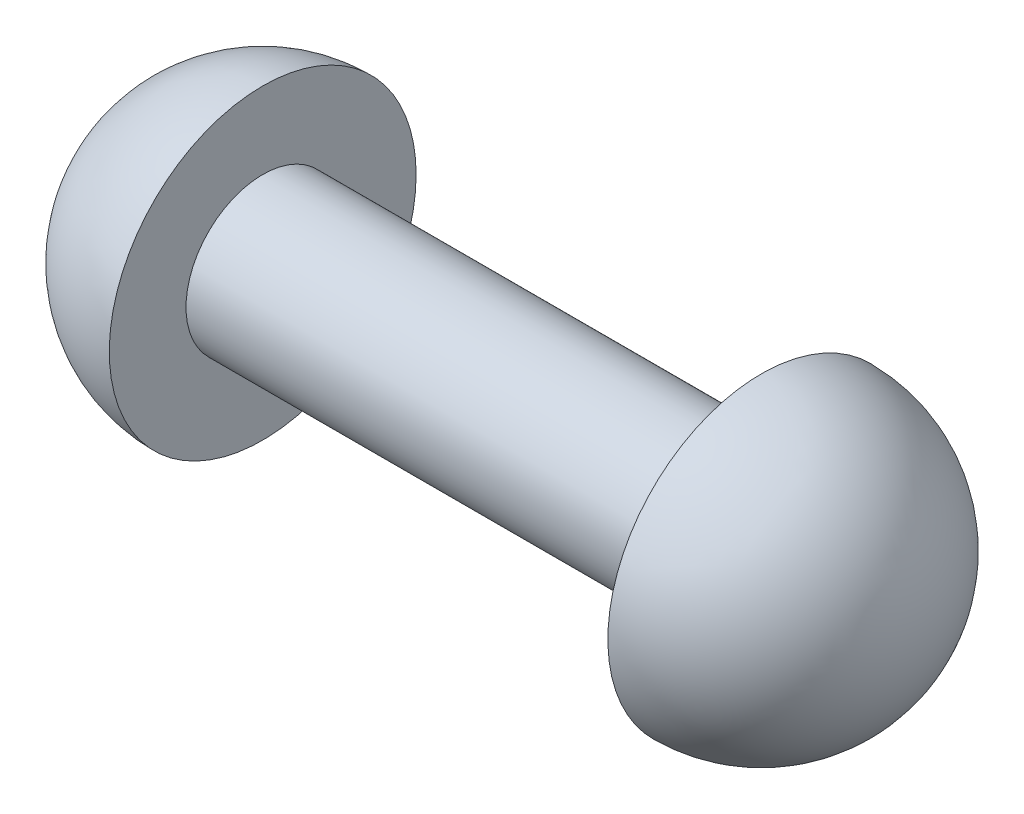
ISO-10303-21;
HEADER;
FILE_DESCRIPTION(('STEP AP214'),'2;1');
FILE_NAME('part.step','',(''),(''),'','','');
FILE_SCHEMA(('AUTOMOTIVE_DESIGN { 1 0 10303 214 1 1 1 1 }'));
ENDSEC;
DATA;
#1=APPLICATION_CONTEXT('core data for automotive mechanical design processes');
#2=APPLICATION_PROTOCOL_DEFINITION('international standard','automotive_design',2000,#1);
#3=PRODUCT_CONTEXT('',#1,'mechanical');
#4=PRODUCT('Part','Part','',(#3));
#5=PRODUCT_RELATED_PRODUCT_CATEGORY('part','',(#4));
#6=PRODUCT_DEFINITION_FORMATION('','',#4);
#7=PRODUCT_DEFINITION_CONTEXT('part definition',#1,'design');
#8=PRODUCT_DEFINITION('design','',#6,#7);
#9=PRODUCT_DEFINITION_SHAPE('','',#8);
#10=(LENGTH_UNIT() NAMED_UNIT(*) SI_UNIT(.MILLI.,.METRE.));
#11=(NAMED_UNIT(*) PLANE_ANGLE_UNIT() SI_UNIT($,.RADIAN.));
#12=(NAMED_UNIT(*) SI_UNIT($,.STERADIAN.) SOLID_ANGLE_UNIT());
#13=UNCERTAINTY_MEASURE_WITH_UNIT(LENGTH_MEASURE(1.E-05),#10,'distance_accuracy_value','');
#14=(GEOMETRIC_REPRESENTATION_CONTEXT(3) GLOBAL_UNCERTAINTY_ASSIGNED_CONTEXT((#13)) GLOBAL_UNIT_ASSIGNED_CONTEXT((#10,
#11,#12)) REPRESENTATION_CONTEXT('',''));
#15=CARTESIAN_POINT('',(0.,0.,0.));
#16=DIRECTION('',(0.,0.,1.));
#17=DIRECTION('',(1.,0.,0.));
#18=AXIS2_PLACEMENT_3D('',#15,#16,#17);
#19=CARTESIAN_POINT('',(0.,0.,0.));
#20=DIRECTION('',(1.,0.,0.));
#21=DIRECTION('',(0.,-1.,0.));
#22=AXIS2_PLACEMENT_3D('',#19,#20,#21);
#23=SPHERICAL_SURFACE('',#22,8.);
#24=CARTESIAN_POINT('',(0.,0.,0.));
#25=DIRECTION('',(1.,0.,0.));
#26=DIRECTION('',(0.,0.,-1.));
#27=AXIS2_PLACEMENT_3D('',#24,#25,#26);
#28=CIRCLE('',#27,8.);
#29=CARTESIAN_POINT('',(0.,0.,-8.));
#30=VERTEX_POINT('',#29);
#31=EDGE_CURVE('E10',#30,#30,#28,.T.);
#32=ORIENTED_EDGE('',*,*,#31,.T.);
#33=EDGE_LOOP('',(#32));
#34=FACE_BOUND('',#33,.T.);
#35=ADVANCED_FACE('F348',(#34),#23,.T.);
#36=CARTESIAN_POINT('',(0.,8.,0.));
#37=DIRECTION('',(-1.,0.,0.));
#38=DIRECTION('',(0.,0.,1.));
#39=AXIS2_PLACEMENT_3D('',#36,#37,#38);
#40=PLANE('',#39);
#41=CARTESIAN_POINT('',(0.,0.,0.));
#42=DIRECTION('',(1.,0.,0.));
#43=DIRECTION('',(0.,0.,-1.));
#44=AXIS2_PLACEMENT_3D('',#41,#42,#43);
#45=CIRCLE('',#44,4.);
#46=CARTESIAN_POINT('',(0.,0.,-4.));
#47=VERTEX_POINT('',#46);
#48=EDGE_CURVE('E354',#47,#47,#45,.T.);
#49=ORIENTED_EDGE('',*,*,#48,.T.);
#50=EDGE_LOOP('',(#49));
#51=FACE_BOUND('',#50,.T.);
#52=ORIENTED_EDGE('',*,*,#31,.F.);
#53=EDGE_LOOP('',(#52));
#54=FACE_BOUND('',#53,.T.);
#55=ADVANCED_FACE('F380',(#51,#54),#40,.T.);
#56=CARTESIAN_POINT('',(10.9,0.,0.));
#57=DIRECTION('',(1.,0.,0.));
#58=DIRECTION('',(0.,0.,-1.));
#59=AXIS2_PLACEMENT_3D('',#56,#57,#58);
#60=CYLINDRICAL_SURFACE('',#59,4.);
#61=CARTESIAN_POINT('',(-26.,0.,0.));
#62=DIRECTION('',(1.,0.,0.));
#63=DIRECTION('',(0.,0.,-1.));
#64=AXIS2_PLACEMENT_3D('',#61,#62,#63);
#65=CIRCLE('',#64,4.);
#66=CARTESIAN_POINT('',(-26.,0.,-4.));
#67=VERTEX_POINT('',#66);
#68=EDGE_CURVE('E358',#67,#67,#65,.T.);
#69=ORIENTED_EDGE('',*,*,#68,.T.);
#70=EDGE_LOOP('',(#69));
#71=FACE_BOUND('',#70,.T.);
#72=ORIENTED_EDGE('',*,*,#48,.F.);
#73=EDGE_LOOP('',(#72));
#74=FACE_BOUND('',#73,.T.);
#75=ADVANCED_FACE('F377',(#71,#74),#60,.T.);
#76=CARTESIAN_POINT('',(-26.,4.,0.));
#77=DIRECTION('',(1.,0.,0.));
#78=DIRECTION('',(0.,0.,-1.));
#79=AXIS2_PLACEMENT_3D('',#76,#77,#78);
#80=PLANE('',#79);
#81=CARTESIAN_POINT('',(-26.,0.,0.));
#82=DIRECTION('',(1.,0.,0.));
#83=DIRECTION('',(0.,0.,-1.));
#84=AXIS2_PLACEMENT_3D('',#81,#82,#83);
#85=CIRCLE('',#84,8.);
#86=CARTESIAN_POINT('',(-26.,0.,-8.));
#87=VERTEX_POINT('',#86);
#88=EDGE_CURVE('E362',#87,#87,#85,.T.);
#89=ORIENTED_EDGE('',*,*,#88,.T.);
#90=EDGE_LOOP('',(#89));
#91=FACE_BOUND('',#90,.T.);
#92=ORIENTED_EDGE('',*,*,#68,.F.);
#93=EDGE_LOOP('',(#92));
#94=FACE_BOUND('',#93,.T.);
#95=ADVANCED_FACE('F368',(#91,#94),#80,.T.);
#96=CARTESIAN_POINT('',(-26.,0.,0.));
#97=DIRECTION('',(1.,0.,0.));
#98=DIRECTION('',(0.,1.,0.));
#99=AXIS2_PLACEMENT_3D('',#96,#97,#98);
#100=SPHERICAL_SURFACE('',#99,8.);
#101=ORIENTED_EDGE('',*,*,#88,.F.);
#102=EDGE_LOOP('',(#101));
#103=FACE_BOUND('',#102,.T.);
#104=ADVANCED_FACE('F371',(#103),#100,.T.);
#105=CLOSED_SHELL('',(#35,#55,#75,#95,#104));
#106=MANIFOLD_SOLID_BREP('B2',#105);
#107=ADVANCED_BREP_SHAPE_REPRESENTATION('',(#18,#106),#14);
#108=SHAPE_DEFINITION_REPRESENTATION(#9,#107);
ENDSEC;
END-ISO-10303-21;
